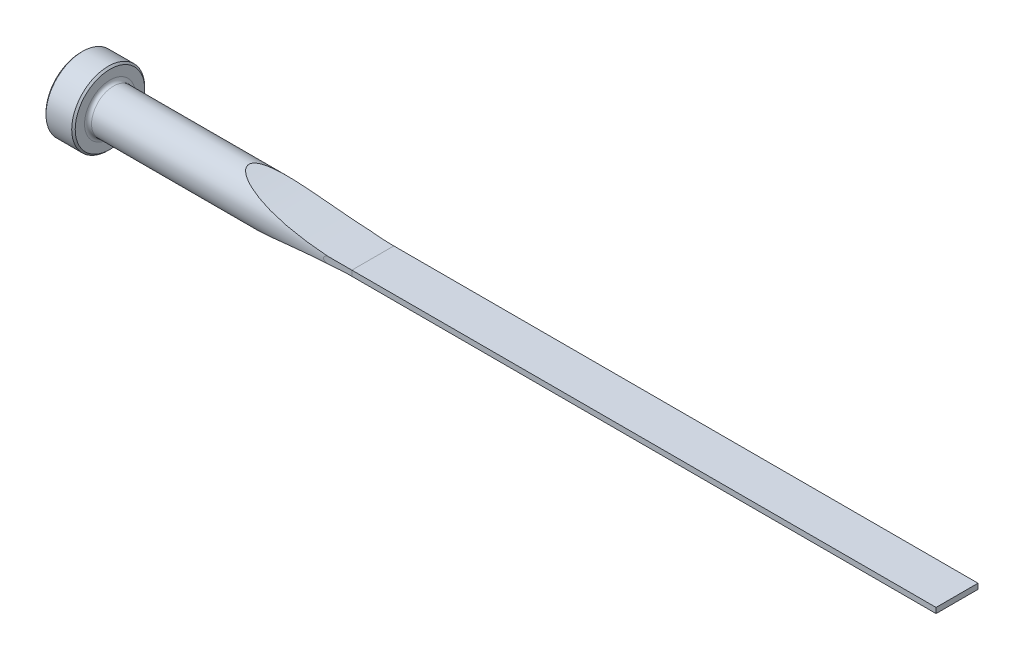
from build123d import *

# Parameters (mm, degrees)
CUT_EXTRUDE1_DEPTH = 191.830442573
CUT_EXTRUDE2_DEPTH = 191.830442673
FILLET1_R          = 0.762
CHAMFER1_SIZE      = 0.381


with BuildPart() as part:
    # Sketch1 → Revolve1 (revolve)
    with BuildSketch(Plane.XY, mode=Mode.PRIVATE) as revolve1_sk:
        Polygon((0, 0), (0, 7.9375), (6.35, 7.9375), (6.35, 4.7625), (190.5, 4.7625), (190.5, 0), align=None)
    revolve(revolve1_sk.sketch.rotate(Axis((0, 0, 0), (1, 0, 0)), 90), axis=Axis((0, 0, 0), (1, 0, 0)))

    # Sketch2 → Cut-Extrude1 (cut, symmetric)
    with BuildSketch(Plane.XY):
        with BuildLine():
            Line((190.5, 4.7625), (190.5, 0.5842))
            Line((190.5, 0.5842), (63.5, 0.5842))
            ThreePointArc((63.5, 0.5842), (49.871888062, 1.634985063), (36.565940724, 4.7625))
            Line((36.565940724, 4.7625), (190.5, 4.7625))
        make_face()
    cut_extrude1 = extrude(amount=CUT_EXTRUDE1_DEPTH, both=True, mode=Mode.SUBTRACT)

    # Mirror1: Cut-Extrude1 across plane
    add(cut_extrude1.mirror(Plane.ZX), mode=Mode.SUBTRACT)

    # Sketch3 → Cut-Extrude2 (cut, symmetric)
    with BuildSketch(Plane(origin=(0, 0, 0), x_dir=(1, 0, 0), z_dir=(0, 1, 0))):
        with BuildLine():
            Line((190.5, 4.7625), (190.5, 4.5593))
            Line((190.5, 4.5593), (63.5, 4.5593))
            ThreePointArc((63.5, 4.5593), (60.49463147, 4.610114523), (57.492698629, 4.7625))
            Line((57.492698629, 4.7625), (190.5, 4.7625))
        make_face()
    cut_extrude2 = extrude(amount=CUT_EXTRUDE2_DEPTH, both=True, mode=Mode.SUBTRACT)

    # Mirror2: Cut-Extrude2 across plane
    add(cut_extrude2.mirror(Plane.XY), mode=Mode.SUBTRACT)

    # Fillet1
    fillet1_edges = [part.edges().sort_by_distance(p)[0] for p in [
        (6.35, 0, -4.7625),
    ]]
    fillet(fillet1_edges, radius=FILLET1_R)

    # Chamfer1
    chamfer1_edges = [part.edges().sort_by_distance(p)[0] for p in [
        (6.35, 0, -7.9375),
        (0, 0, -7.9375),
    ]]
    chamfer(chamfer1_edges, length=CHAMFER1_SIZE)


solid = part.part
